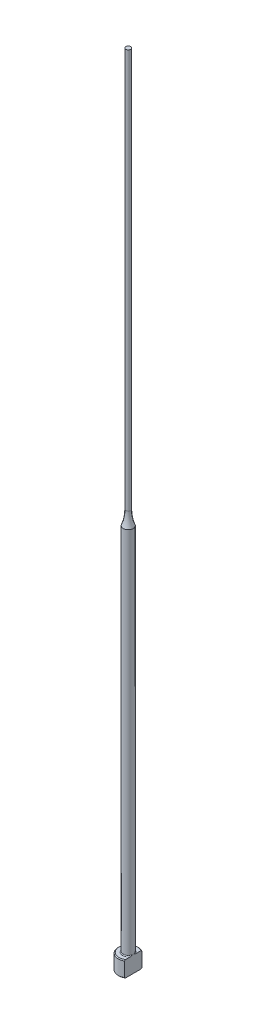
ISO-10303-21;
HEADER;
FILE_DESCRIPTION(('STEP AP214'),'2;1');
FILE_NAME('part.step','',(''),(''),'','','');
FILE_SCHEMA(('AUTOMOTIVE_DESIGN { 1 0 10303 214 1 1 1 1 }'));
ENDSEC;
DATA;
#1=APPLICATION_CONTEXT('core data for automotive mechanical design processes');
#2=APPLICATION_PROTOCOL_DEFINITION('international standard','automotive_design',2000,#1);
#3=PRODUCT_CONTEXT('',#1,'mechanical');
#4=PRODUCT('Part','Part','',(#3));
#5=PRODUCT_RELATED_PRODUCT_CATEGORY('part','',(#4));
#6=PRODUCT_DEFINITION_FORMATION('','',#4);
#7=PRODUCT_DEFINITION_CONTEXT('part definition',#1,'design');
#8=PRODUCT_DEFINITION('design','',#6,#7);
#9=PRODUCT_DEFINITION_SHAPE('','',#8);
#10=(LENGTH_UNIT() NAMED_UNIT(*) SI_UNIT(.MILLI.,.METRE.));
#11=(NAMED_UNIT(*) PLANE_ANGLE_UNIT() SI_UNIT($,.RADIAN.));
#12=(NAMED_UNIT(*) SI_UNIT($,.STERADIAN.) SOLID_ANGLE_UNIT());
#13=UNCERTAINTY_MEASURE_WITH_UNIT(LENGTH_MEASURE(1.E-05),#10,'distance_accuracy_value','');
#14=(GEOMETRIC_REPRESENTATION_CONTEXT(3) GLOBAL_UNCERTAINTY_ASSIGNED_CONTEXT((#13)) GLOBAL_UNIT_ASSIGNED_CONTEXT((#10,
#11,#12)) REPRESENTATION_CONTEXT('',''));
#15=CARTESIAN_POINT('',(0.,0.,0.));
#16=DIRECTION('',(0.,0.,1.));
#17=DIRECTION('',(1.,0.,0.));
#18=AXIS2_PLACEMENT_3D('',#15,#16,#17);
#19=CARTESIAN_POINT('',(-2.49999999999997,4.,0.));
#20=DIRECTION('',(0.,1.,0.));
#21=DIRECTION('',(0.,0.,1.));
#22=AXIS2_PLACEMENT_3D('',#19,#20,#21);
#23=PLANE('',#22);
#24=CARTESIAN_POINT('',(0.,4.,0.));
#25=DIRECTION('',(0.,1.,0.));
#26=DIRECTION('',(0.,0.,1.));
#27=AXIS2_PLACEMENT_3D('',#24,#25,#26);
#28=CIRCLE('',#27,2.3);
#29=CARTESIAN_POINT('',(1.24999999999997,4.,-1.9306734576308));
#30=VERTEX_POINT('',#29);
#31=CARTESIAN_POINT('',(1.24999999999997,4.,1.9306734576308));
#32=VERTEX_POINT('',#31);
#33=EDGE_CURVE('E187',#30,#32,#28,.T.);
#34=ORIENTED_EDGE('',*,*,#33,.T.);
#35=DIRECTION('',(0.,0.,-1.));
#36=VECTOR('',#35,1.);
#37=CARTESIAN_POINT('',(1.24999999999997,4.,0.));
#38=LINE('',#37,#36);
#39=CARTESIAN_POINT('',(1.24999999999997,3.99999999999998,0.734846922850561));
#40=VERTEX_POINT('',#39);
#41=EDGE_CURVE('E57',#32,#40,#38,.T.);
#42=ORIENTED_EDGE('',*,*,#41,.T.);
#43=CARTESIAN_POINT('',(0.,4.,0.));
#44=DIRECTION('',(0.,1.,0.));
#45=DIRECTION('',(0.,0.,1.));
#46=AXIS2_PLACEMENT_3D('',#43,#44,#45);
#47=CIRCLE('',#46,1.44999999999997);
#48=CARTESIAN_POINT('',(1.24999999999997,3.99999999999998,-0.734846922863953));
#49=VERTEX_POINT('',#48);
#50=EDGE_CURVE('E108',#40,#49,#47,.F.);
#51=ORIENTED_EDGE('',*,*,#50,.T.);
#52=EDGE_CURVE('E137',#49,#30,#38,.T.);
#53=ORIENTED_EDGE('',*,*,#52,.T.);
#54=EDGE_LOOP('',(#34,#42,#51,#53));
#55=FACE_BOUND('',#54,.T.);
#56=ADVANCED_FACE('F32',(#55),#23,.T.);
#57=CARTESIAN_POINT('',(0.,259.958771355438,0.));
#58=DIRECTION('',(0.,1.,0.));
#59=DIRECTION('',(0.,0.,1.));
#60=AXIS2_PLACEMENT_3D('',#57,#58,#59);
#61=CYLINDRICAL_SURFACE('',#60,2.49999999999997);
#62=CARTESIAN_POINT('',(0.,3.80000000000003,0.));
#63=DIRECTION('',(0.,1.,0.));
#64=DIRECTION('',(0.,0.,1.));
#65=AXIS2_PLACEMENT_3D('',#62,#63,#64);
#66=CIRCLE('',#65,2.49999999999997);
#67=CARTESIAN_POINT('',(1.24999999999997,3.80000000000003,2.16506350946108));
#68=VERTEX_POINT('',#67);
#69=CARTESIAN_POINT('',(1.24999999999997,3.80000000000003,-2.16506350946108));
#70=VERTEX_POINT('',#69);
#71=EDGE_CURVE('E105',#68,#70,#66,.F.);
#72=ORIENTED_EDGE('',*,*,#71,.T.);
#73=DIRECTION('',(0.,-1.,0.));
#74=VECTOR('',#73,1.);
#75=CARTESIAN_POINT('',(1.24999999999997,200.,-2.16506350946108));
#76=LINE('',#75,#74);
#77=CARTESIAN_POINT('',(1.24999999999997,0.199999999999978,-2.16506350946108));
#78=VERTEX_POINT('',#77);
#79=EDGE_CURVE('E193',#70,#78,#76,.T.);
#80=ORIENTED_EDGE('',*,*,#79,.T.);
#81=CARTESIAN_POINT('',(0.,0.199999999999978,0.));
#82=DIRECTION('',(0.,-1.,0.));
#83=DIRECTION('',(0.,0.,-1.));
#84=AXIS2_PLACEMENT_3D('',#81,#82,#83);
#85=CIRCLE('',#84,2.49999999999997);
#86=CARTESIAN_POINT('',(1.24999999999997,0.199999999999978,2.16506350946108));
#87=VERTEX_POINT('',#86);
#88=EDGE_CURVE('E100',#78,#87,#85,.F.);
#89=ORIENTED_EDGE('',*,*,#88,.T.);
#90=DIRECTION('',(0.,-1.,0.));
#91=VECTOR('',#90,1.);
#92=CARTESIAN_POINT('',(1.24999999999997,200.,2.16506350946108));
#93=LINE('',#92,#91);
#94=EDGE_CURVE('E93',#68,#87,#93,.T.);
#95=ORIENTED_EDGE('',*,*,#94,.F.);
#96=EDGE_LOOP('',(#72,#80,#89,#95));
#97=FACE_BOUND('',#96,.T.);
#98=ADVANCED_FACE('F158',(#97),#61,.T.);
#99=CARTESIAN_POINT('',(0.,0.,0.));
#100=DIRECTION('',(0.,-1.,0.));
#101=DIRECTION('',(0.,0.,-1.));
#102=AXIS2_PLACEMENT_3D('',#99,#100,#101);
#103=PLANE('',#102);
#104=CARTESIAN_POINT('',(0.,0.,0.));
#105=DIRECTION('',(0.,-1.,0.));
#106=DIRECTION('',(0.,0.,-1.));
#107=AXIS2_PLACEMENT_3D('',#104,#105,#106);
#108=CIRCLE('',#107,2.29999999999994);
#109=CARTESIAN_POINT('',(1.24999999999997,0.,1.93067345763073));
#110=VERTEX_POINT('',#109);
#111=CARTESIAN_POINT('',(1.24999999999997,0.,-1.93067345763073));
#112=VERTEX_POINT('',#111);
#113=EDGE_CURVE('E98',#110,#112,#108,.T.);
#114=ORIENTED_EDGE('',*,*,#113,.T.);
#115=DIRECTION('',(0.,0.,1.));
#116=VECTOR('',#115,1.);
#117=CARTESIAN_POINT('',(1.24999999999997,0.,2.16506350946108));
#118=LINE('',#117,#116);
#119=EDGE_CURVE('E83',#112,#110,#118,.T.);
#120=ORIENTED_EDGE('',*,*,#119,.T.);
#121=EDGE_LOOP('',(#114,#120));
#122=FACE_BOUND('',#121,.T.);
#123=ADVANCED_FACE('F103',(#122),#103,.T.);
#124=CARTESIAN_POINT('',(0.,4.,0.));
#125=DIRECTION('',(0.,-1.,0.));
#126=DIRECTION('',(0.,0.,-1.));
#127=AXIS2_PLACEMENT_3D('',#124,#125,#126);
#128=CONICAL_SURFACE('',#127,2.3,0.785398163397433);
#129=ORIENTED_EDGE('',*,*,#71,.F.);
#130=CARTESIAN_POINT('',(1.24999999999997,1.37269850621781,4.76610952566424));
#131=CARTESIAN_POINT('',(1.24999999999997,1.47721375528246,4.6580533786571));
#132=CARTESIAN_POINT('',(1.24999999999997,1.58161686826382,4.54988840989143));
#133=CARTESIAN_POINT('',(1.24999999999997,1.79013244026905,4.33327605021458));
#134=CARTESIAN_POINT('',(1.24999999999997,1.89424489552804,4.22482865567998));
#135=CARTESIAN_POINT('',(1.24999999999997,2.10216338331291,4.00753373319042));
#136=CARTESIAN_POINT('',(1.24999999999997,2.20596923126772,3.89868602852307));
#137=CARTESIAN_POINT('',(1.24999999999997,2.41312192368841,3.68055575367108));
#138=CARTESIAN_POINT('',(1.24999999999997,2.51646877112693,3.57127318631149));
#139=CARTESIAN_POINT('',(1.24999999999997,2.72052253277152,3.35432408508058));
#140=CARTESIAN_POINT('',(1.24999999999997,2.82124112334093,3.24666854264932));
#141=CARTESIAN_POINT('',(1.24999999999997,3.02192410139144,3.03065701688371));
#142=CARTESIAN_POINT('',(1.24999999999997,3.12188849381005,2.92230103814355));
#143=CARTESIAN_POINT('',(1.24999999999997,3.32077037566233,2.70467415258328));
#144=CARTESIAN_POINT('',(1.24999999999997,3.41968808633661,2.59540344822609));
#145=CARTESIAN_POINT('',(1.24999999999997,3.61608273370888,2.37557697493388));
#146=CARTESIAN_POINT('',(1.24999999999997,3.71355972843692,2.26502125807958));
#147=CARTESIAN_POINT('',(1.24999999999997,3.86911393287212,2.08515617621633));
#148=CARTESIAN_POINT('',(1.24999999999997,3.92785594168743,2.01642247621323));
#149=CARTESIAN_POINT('',(1.24999999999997,4.0442937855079,1.87806056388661));
#150=CARTESIAN_POINT('',(1.24999999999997,4.10198951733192,1.80843226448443));
#151=CARTESIAN_POINT('',(1.24999999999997,4.21658041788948,1.66728976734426));
#152=CARTESIAN_POINT('',(1.24999999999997,4.27346067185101,1.59576341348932));
#153=CARTESIAN_POINT('',(1.24999999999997,4.38522965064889,1.45118948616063));
#154=CARTESIAN_POINT('',(1.24999999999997,4.44011885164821,1.37814228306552));
#155=CARTESIAN_POINT('',(1.24999999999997,4.54788773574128,1.22886697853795));
#156=CARTESIAN_POINT('',(1.24999999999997,4.60072420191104,1.15260740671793));
#157=CARTESIAN_POINT('',(1.24999999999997,4.70212030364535,0.997098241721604));
#158=CARTESIAN_POINT('',(1.24999999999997,4.75067405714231,0.917844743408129));
#159=CARTESIAN_POINT('',(1.24999999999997,4.84043729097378,0.756494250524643));
#160=CARTESIAN_POINT('',(1.24999999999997,4.88173033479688,0.674444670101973));
#161=CARTESIAN_POINT('',(1.24999999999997,4.95366083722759,0.505835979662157));
#162=CARTESIAN_POINT('',(1.24999999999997,4.98433405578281,0.419293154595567));
#163=CARTESIAN_POINT('',(1.24999999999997,5.01753107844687,0.289507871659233));
#164=CARTESIAN_POINT('',(1.24999999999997,5.02633539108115,0.247870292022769));
#165=CARTESIAN_POINT('',(1.24999999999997,5.03997448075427,0.163937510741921));
#166=CARTESIAN_POINT('',(1.24999999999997,5.0448096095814,0.12164236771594));
#167=CARTESIAN_POINT('',(1.24999999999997,5.0501678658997,0.0369068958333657));
#168=CARTESIAN_POINT('',(1.24999999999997,5.05070431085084,-0.00553257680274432));
#169=CARTESIAN_POINT('',(1.24999999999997,5.04746162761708,-0.0902467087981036));
#170=CARTESIAN_POINT('',(1.24999999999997,5.04368214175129,-0.132521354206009));
#171=CARTESIAN_POINT('',(1.24999999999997,5.0321226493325,-0.21613542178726));
#172=CARTESIAN_POINT('',(1.24999999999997,5.02437758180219,-0.2574797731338));
#173=CARTESIAN_POINT('',(1.24999999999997,5.00536735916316,-0.339354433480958));
#174=CARTESIAN_POINT('',(1.24999999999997,4.99410082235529,-0.379884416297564));
#175=CARTESIAN_POINT('',(1.24999999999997,4.96852211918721,-0.460209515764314));
#176=CARTESIAN_POINT('',(1.24999999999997,4.954193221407,-0.499999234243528));
#177=CARTESIAN_POINT('',(1.24999999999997,4.92306392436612,-0.578577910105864));
#178=CARTESIAN_POINT('',(1.24999999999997,4.90626403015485,-0.617367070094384));
#179=CARTESIAN_POINT('',(1.24999999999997,4.85269034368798,-0.732719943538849));
#180=CARTESIAN_POINT('',(1.24999999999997,4.81287978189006,-0.807869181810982));
#181=CARTESIAN_POINT('',(1.24999999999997,4.72799210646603,-0.955157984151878));
#182=CARTESIAN_POINT('',(1.24999999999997,4.68290855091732,-1.02729371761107));
#183=CARTESIAN_POINT('',(1.24999999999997,4.58903993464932,-1.16950551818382));
#184=CARTESIAN_POINT('',(1.24999999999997,4.5402409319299,-1.23957230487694));
#185=CARTESIAN_POINT('',(1.24999999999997,4.44021824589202,-1.37788366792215));
#186=CARTESIAN_POINT('',(1.24999999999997,4.38899576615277,-1.44612912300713));
#187=CARTESIAN_POINT('',(1.24999999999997,4.28411092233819,-1.58215279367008));
#188=CARTESIAN_POINT('',(1.24999999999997,4.23042529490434,-1.64991298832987));
#189=CARTESIAN_POINT('',(1.24999999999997,4.12172412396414,-1.7843605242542));
#190=CARTESIAN_POINT('',(1.24999999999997,4.06670849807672,-1.85104779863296));
#191=CARTESIAN_POINT('',(1.24999999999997,3.90044437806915,-2.04954410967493));
#192=CARTESIAN_POINT('',(1.24999999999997,3.78772044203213,-2.1801152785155));
#193=CARTESIAN_POINT('',(1.24999999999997,3.57927088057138,-2.41711311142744));
#194=CARTESIAN_POINT('',(1.24999999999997,3.48391557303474,-2.52386864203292));
#195=CARTESIAN_POINT('',(1.24999999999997,3.29202937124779,-2.73632311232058));
#196=CARTESIAN_POINT('',(1.24999999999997,3.19549844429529,-2.84202202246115));
#197=CARTESIAN_POINT('',(1.24999999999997,2.90446939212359,-3.15815976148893));
#198=CARTESIAN_POINT('',(1.24999999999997,2.70871394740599,-3.36743889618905));
#199=CARTESIAN_POINT('',(1.24999999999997,2.32338273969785,-3.77561196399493));
#200=CARTESIAN_POINT('',(1.24999999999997,2.13388401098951,-3.97457897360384));
#201=CARTESIAN_POINT('',(1.24999999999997,1.84887947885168,-4.27209258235));
#202=CARTESIAN_POINT('',(1.24999999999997,1.75380504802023,-4.37105278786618));
#203=CARTESIAN_POINT('',(1.24999999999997,1.56341833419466,-4.56874260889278));
#204=CARTESIAN_POINT('',(1.24999999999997,1.46810605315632,-4.66747222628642));
#205=CARTESIAN_POINT('',(1.24999999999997,1.37269850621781,-4.76610952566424));
#206=B_SPLINE_CURVE_WITH_KNOTS('',3,(#130,#131,#132,#133,#134,#135,#136,#137,#138,#139,#140,
#141,#142,#143,#144,#145,#146,#147,#148,#149,#150,#151,#152,#153,#154,#155,#156,#157,#158,#159,
#160,#161,#162,#163,#164,#165,#166,#167,#168,#169,#170,#171,#172,#173,#174,#175,#176,#177,#178,
#179,#180,#181,#182,#183,#184,#185,#186,#187,#188,#189,#190,#191,#192,#193,#194,#195,#196,#197,
#198,#199,#200,#201,#202,#203,#204,#205),.UNSPECIFIED.,.F.,.F.,(4,2,2,2,2,2,2,2,2,2,2,2,2,2,2,2,
2,2,2,2,2,2,2,2,2,2,2,2,2,2,2,2,2,2,2,2,2,4),(0.,0.450994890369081,0.901995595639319,
1.35322763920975,1.80445675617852,2.24672733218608,2.6889950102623,3.13116725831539,
3.57332164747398,3.84456018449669,4.11582532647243,4.38995864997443,4.66402597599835,
4.94225842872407,5.22086725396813,5.49602313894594,5.77024327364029,5.89775644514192,
6.02525831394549,6.15236502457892,6.27948226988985,6.4054983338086,6.531563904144,
6.65833670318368,6.78508362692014,7.03983854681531,7.2949080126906,7.55098686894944,
7.80693985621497,8.06626716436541,8.32561057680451,8.84304654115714,9.27246240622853,
9.70189024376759,10.5615524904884,11.385852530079,11.7975442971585,12.2092326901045),.UNSPECIFIED.);
#207=EDGE_CURVE('E136',#68,#32,#206,.T.);
#208=ORIENTED_EDGE('',*,*,#207,.T.);
#209=ORIENTED_EDGE('',*,*,#33,.F.);
#210=EDGE_CURVE('E128',#30,#70,#206,.T.);
#211=ORIENTED_EDGE('',*,*,#210,.T.);
#212=EDGE_LOOP('',(#129,#208,#209,#211));
#213=FACE_BOUND('',#212,.T.);
#214=ADVANCED_FACE('F144',(#213),#128,.T.);
#215=CARTESIAN_POINT('',(0.,0.199999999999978,0.));
#216=DIRECTION('',(0.,1.,0.));
#217=DIRECTION('',(0.,0.,1.));
#218=AXIS2_PLACEMENT_3D('',#215,#216,#217);
#219=CONICAL_SURFACE('',#218,2.49999999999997,0.785398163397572);
#220=ORIENTED_EDGE('',*,*,#88,.F.);
#221=CARTESIAN_POINT('',(1.24999999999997,2.62730149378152,-4.76610952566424));
#222=CARTESIAN_POINT('',(1.24999999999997,2.52278624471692,-4.65805337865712));
#223=CARTESIAN_POINT('',(1.24999999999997,2.41838313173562,-4.54988840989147));
#224=CARTESIAN_POINT('',(1.24999999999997,2.20986755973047,-4.33327605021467));
#225=CARTESIAN_POINT('',(1.24999999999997,2.10575510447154,-4.22482865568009));
#226=CARTESIAN_POINT('',(1.24999999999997,1.89783661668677,-4.00753373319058));
#227=CARTESIAN_POINT('',(1.24999999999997,1.794030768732,-3.89868602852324));
#228=CARTESIAN_POINT('',(1.24999999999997,1.58687807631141,-3.6805557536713));
#229=CARTESIAN_POINT('',(1.24999999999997,1.48353122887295,-3.57127318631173));
#230=CARTESIAN_POINT('',(1.24999999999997,1.27947746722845,-3.35432408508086));
#231=CARTESIAN_POINT('',(1.24999999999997,1.17875887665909,-3.24666854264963));
#232=CARTESIAN_POINT('',(1.24999999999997,0.978075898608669,-3.03065701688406));
#233=CARTESIAN_POINT('',(1.24999999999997,0.878111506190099,-2.92230103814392));
#234=CARTESIAN_POINT('',(1.24999999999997,0.67922962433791,-2.70467415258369));
#235=CARTESIAN_POINT('',(1.24999999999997,0.580311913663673,-2.59540344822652));
#236=CARTESIAN_POINT('',(1.24999999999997,0.383917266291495,-2.37557697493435));
#237=CARTESIAN_POINT('',(1.24999999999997,0.286440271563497,-2.26502125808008));
#238=CARTESIAN_POINT('',(1.24999999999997,0.130886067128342,-2.08515617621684));
#239=CARTESIAN_POINT('',(1.24999999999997,0.0721440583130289,-2.01642247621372));
#240=CARTESIAN_POINT('',(1.24999999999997,-0.0442937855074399,-1.87806056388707));
#241=CARTESIAN_POINT('',(1.24999999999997,-0.101989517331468,-1.80843226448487));
#242=CARTESIAN_POINT('',(1.24999999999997,-0.216580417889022,-1.66728976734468));
#243=CARTESIAN_POINT('',(1.24999999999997,-0.273460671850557,-1.59576341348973));
#244=CARTESIAN_POINT('',(1.24999999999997,-0.385229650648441,-1.45118948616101));
#245=CARTESIAN_POINT('',(1.24999999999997,-0.440118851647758,-1.37814228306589));
#246=CARTESIAN_POINT('',(1.24999999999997,-0.547887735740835,-1.22886697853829));
#247=CARTESIAN_POINT('',(1.24999999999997,-0.600724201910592,-1.15260740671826));
#248=CARTESIAN_POINT('',(1.24999999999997,-0.702120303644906,-0.99709824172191));
#249=CARTESIAN_POINT('',(1.24999999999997,-0.750674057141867,-0.917844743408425));
#250=CARTESIAN_POINT('',(1.24999999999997,-0.840437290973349,-0.756494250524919));
#251=CARTESIAN_POINT('',(1.24999999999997,-0.881730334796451,-0.67444467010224));
#252=CARTESIAN_POINT('',(1.24999999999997,-0.953660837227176,-0.505835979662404));
#253=CARTESIAN_POINT('',(1.24999999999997,-0.984334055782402,-0.419293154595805));
#254=CARTESIAN_POINT('',(1.24999999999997,-1.01753107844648,-0.289507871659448));
#255=CARTESIAN_POINT('',(1.24999999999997,-1.02633539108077,-0.247870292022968));
#256=CARTESIAN_POINT('',(1.24999999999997,-1.0399744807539,-0.163937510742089));
#257=CARTESIAN_POINT('',(1.24999999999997,-1.04480960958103,-0.121642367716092));
#258=CARTESIAN_POINT('',(1.24999999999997,-1.05016786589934,-0.036906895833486));
#259=CARTESIAN_POINT('',(1.24999999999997,-1.05070431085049,0.00553257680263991));
#260=CARTESIAN_POINT('',(1.24999999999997,-1.04746162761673,0.0902467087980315));
#261=CARTESIAN_POINT('',(1.24999999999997,-1.04368214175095,0.132521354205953));
#262=CARTESIAN_POINT('',(1.24999999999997,-1.03212264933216,0.216135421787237));
#263=CARTESIAN_POINT('',(1.24999999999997,-1.02437758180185,0.257479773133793));
#264=CARTESIAN_POINT('',(1.24999999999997,-1.00536735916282,0.339354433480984));
#265=CARTESIAN_POINT('',(1.24999999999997,-0.99410082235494,0.379884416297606));
#266=CARTESIAN_POINT('',(1.24999999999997,-0.968522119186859,0.460209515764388));
#267=CARTESIAN_POINT('',(1.24999999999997,-0.954193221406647,0.499999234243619));
#268=CARTESIAN_POINT('',(1.24999999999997,-0.923063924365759,0.578577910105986));
#269=CARTESIAN_POINT('',(1.24999999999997,-0.906264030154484,0.617367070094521));
#270=CARTESIAN_POINT('',(1.24999999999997,-0.852690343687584,0.732719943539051));
#271=CARTESIAN_POINT('',(1.24999999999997,-0.812879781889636,0.807869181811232));
#272=CARTESIAN_POINT('',(1.24999999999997,-0.72799210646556,0.955157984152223));
#273=CARTESIAN_POINT('',(1.24999999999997,-0.682908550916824,1.02729371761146));
#274=CARTESIAN_POINT('',(1.24999999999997,-0.58903993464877,1.1695055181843));
#275=CARTESIAN_POINT('',(1.24999999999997,-0.540240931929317,1.23957230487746));
#276=CARTESIAN_POINT('',(1.24999999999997,-0.440218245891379,1.37788366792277));
#277=CARTESIAN_POINT('',(1.24999999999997,-0.388995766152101,1.44612912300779));
#278=CARTESIAN_POINT('',(1.24999999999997,-0.284110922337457,1.58215279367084));
#279=CARTESIAN_POINT('',(1.24999999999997,-0.230425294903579,1.64991298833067));
#280=CARTESIAN_POINT('',(1.24999999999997,-0.121724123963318,1.78436052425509));
#281=CARTESIAN_POINT('',(1.24999999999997,-0.066708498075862,1.8510477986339));
#282=CARTESIAN_POINT('',(1.24999999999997,0.0995556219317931,2.049544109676));
#283=CARTESIAN_POINT('',(1.24999999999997,0.212279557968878,2.18011527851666));
#284=CARTESIAN_POINT('',(1.24999999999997,0.420729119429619,2.41711311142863));
#285=CARTESIAN_POINT('',(1.24999999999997,0.516084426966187,2.52386864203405));
#286=CARTESIAN_POINT('',(1.24999999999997,0.707970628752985,2.73632311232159));
#287=CARTESIAN_POINT('',(1.24999999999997,0.804501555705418,2.84202202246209));
#288=CARTESIAN_POINT('',(1.24999999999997,1.09553060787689,3.1581597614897));
#289=CARTESIAN_POINT('',(1.24999999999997,1.29128605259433,3.36743889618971));
#290=CARTESIAN_POINT('',(1.24999999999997,1.67661726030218,3.77561196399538));
#291=CARTESIAN_POINT('',(1.24999999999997,1.86611598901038,3.97457897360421));
#292=CARTESIAN_POINT('',(1.24999999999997,2.151120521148,4.27209258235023));
#293=CARTESIAN_POINT('',(1.24999999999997,2.24619495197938,4.37105278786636));
#294=CARTESIAN_POINT('',(1.24999999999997,2.43658166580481,4.56874260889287));
#295=CARTESIAN_POINT('',(1.24999999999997,2.53189394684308,4.66747222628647));
#296=CARTESIAN_POINT('',(1.24999999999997,2.62730149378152,4.76610952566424));
#297=B_SPLINE_CURVE_WITH_KNOTS('',3,(#221,#222,#223,#224,#225,#226,#227,#228,#229,#230,#231,
#232,#233,#234,#235,#236,#237,#238,#239,#240,#241,#242,#243,#244,#245,#246,#247,#248,#249,#250,
#251,#252,#253,#254,#255,#256,#257,#258,#259,#260,#261,#262,#263,#264,#265,#266,#267,#268,#269,
#270,#271,#272,#273,#274,#275,#276,#277,#278,#279,#280,#281,#282,#283,#284,#285,#286,#287,#288,
#289,#290,#291,#292,#293,#294,#295,#296),.UNSPECIFIED.,.F.,.F.,(4,2,2,2,2,2,2,2,2,2,2,2,2,2,2,2,
2,2,2,2,2,2,2,2,2,2,2,2,2,2,2,2,2,2,2,2,2,4),(0.,0.45099489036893,0.901995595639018,
1.3532276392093,1.80445675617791,2.24672733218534,2.68899501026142,3.13116725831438,
3.57332164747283,3.84456018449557,4.11582532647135,4.38995864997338,4.66402597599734,
4.94225842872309,5.22086725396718,5.49602313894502,5.77024327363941,5.89775644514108,
6.0252583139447,6.15236502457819,6.27948226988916,6.40549833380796,6.5315639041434,
6.65833670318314,6.78508362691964,7.03983854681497,7.29490801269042,7.55098686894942,
7.80693985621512,8.06626716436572,8.32561057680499,8.84304654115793,9.27246240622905,
9.70189024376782,10.5615524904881,11.3858525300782,11.7975442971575,12.2092326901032),.UNSPECIFIED.);
#298=EDGE_CURVE('E86',#78,#112,#297,.T.);
#299=ORIENTED_EDGE('',*,*,#298,.T.);
#300=ORIENTED_EDGE('',*,*,#113,.F.);
#301=EDGE_CURVE('E89',#110,#87,#297,.T.);
#302=ORIENTED_EDGE('',*,*,#301,.T.);
#303=EDGE_LOOP('',(#220,#299,#300,#302));
#304=FACE_BOUND('',#303,.T.);
#305=ADVANCED_FACE('F97',(#304),#219,.T.);
#306=CARTESIAN_POINT('',(0.,4.19999999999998,0.));
#307=DIRECTION('',(0.,1.,0.));
#308=DIRECTION('',(0.,0.,1.));
#309=AXIS2_PLACEMENT_3D('',#306,#307,#308);
#310=TOROIDAL_SURFACE('',#309,1.44999999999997,0.2);
#311=CARTESIAN_POINT('',(1.24999999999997,4.19999999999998,0.));
#312=CARTESIAN_POINT('',(1.24999999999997,4.20000051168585,-1.97682160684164E-10));
#313=CARTESIAN_POINT('',(1.24999999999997,4.20000102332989,-1.08908071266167E-07));
#314=CARTESIAN_POINT('',(1.24999999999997,4.20000200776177,-4.52594777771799E-07));
#315=CARTESIAN_POINT('',(1.24999999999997,4.20000247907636,-6.9099305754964E-07));
#316=CARTESIAN_POINT('',(1.24999999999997,4.20000341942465,-1.26357946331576E-06));
#317=CARTESIAN_POINT('',(1.24999999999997,4.20000388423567,-1.60457621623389E-06));
#318=CARTESIAN_POINT('',(1.24999999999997,4.20000476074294,-2.33954904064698E-06));
#319=CARTESIAN_POINT('',(1.24999999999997,4.2000051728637,-2.73304152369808E-06));
#320=CARTESIAN_POINT('',(1.24999999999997,4.20000655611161,-4.14544018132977E-06));
#321=CARTESIAN_POINT('',(1.24999999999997,4.20000745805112,-5.23310098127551E-06));
#322=CARTESIAN_POINT('',(1.24999999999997,4.20000906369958,-7.47950368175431E-06));
#323=CARTESIAN_POINT('',(1.24999999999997,4.20000977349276,-8.63414445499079E-06));
#324=CARTESIAN_POINT('',(1.24999999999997,4.20001244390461,-1.31453477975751E-05));
#325=CARTESIAN_POINT('',(1.24999999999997,4.20001426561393,-1.65880556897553E-05));
#326=CARTESIAN_POINT('',(1.24999999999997,4.20001724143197,-2.33729030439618E-05));
#327=CARTESIAN_POINT('',(1.24999999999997,4.20001844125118,-2.66956155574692E-05));
#328=CARTESIAN_POINT('',(1.24999999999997,4.20002354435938,-4.08635087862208E-05));
#329=CARTESIAN_POINT('',(1.24999999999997,4.20002741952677,-5.17114616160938E-05));
#330=CARTESIAN_POINT('',(1.24999999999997,4.20003363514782,-7.2005767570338E-05));
#331=CARTESIAN_POINT('',(1.24999999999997,4.20003612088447,-8.14057067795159E-05));
#332=CARTESIAN_POINT('',(1.24999999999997,4.20005581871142,-0.000149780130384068));
#333=CARTESIAN_POINT('',(1.24999999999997,4.20008094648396,-0.00020612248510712));
#334=CARTESIAN_POINT('',(1.24999999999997,4.20017507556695,-0.000425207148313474));
#335=CARTESIAN_POINT('',(1.24999999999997,4.20023819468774,-0.000589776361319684));
#336=CARTESIAN_POINT('',(1.24999999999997,4.20048692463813,-0.00122878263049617));
#337=CARTESIAN_POINT('',(1.24999999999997,4.20067870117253,-0.00170134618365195));
#338=CARTESIAN_POINT('',(1.24999999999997,4.2014602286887,-0.00363636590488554));
#339=CARTESIAN_POINT('',(1.24999999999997,4.20204298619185,-0.00510090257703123));
#340=CARTESIAN_POINT('',(1.24999999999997,4.20939719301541,-0.0235712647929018));
#341=CARTESIAN_POINT('',(1.24999999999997,4.21621259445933,-0.0405643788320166));
#342=CARTESIAN_POINT('',(1.24999999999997,4.22951000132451,-0.0739606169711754));
#343=CARTESIAN_POINT('',(1.24999999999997,4.23599508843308,-0.0903626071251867));
#344=CARTESIAN_POINT('',(1.24999999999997,4.24961430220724,-0.125111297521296));
#345=CARTESIAN_POINT('',(1.24999999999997,4.2567364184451,-0.1434628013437));
#346=CARTESIAN_POINT('',(1.24999999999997,4.27085039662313,-0.180427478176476));
#347=CARTESIAN_POINT('',(1.24999999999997,4.27784022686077,-0.199041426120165));
#348=CARTESIAN_POINT('',(1.24999999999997,4.29479134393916,-0.245221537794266));
#349=CARTESIAN_POINT('',(1.24999999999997,4.30459026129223,-0.272848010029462));
#350=CARTESIAN_POINT('',(1.24999999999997,4.32310234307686,-0.327738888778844));
#351=CARTESIAN_POINT('',(1.24999999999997,4.3318356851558,-0.354996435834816));
#352=CARTESIAN_POINT('',(1.24999999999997,4.3493656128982,-0.413744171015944));
#353=CARTESIAN_POINT('',(1.24999999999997,4.35799470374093,-0.44528522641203));
#354=CARTESIAN_POINT('',(1.24999999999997,4.37338463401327,-0.50909191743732));
#355=CARTESIAN_POINT('',(1.24999999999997,4.38013036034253,-0.541361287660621));
#356=CARTESIAN_POINT('',(1.24999999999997,4.39136059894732,-0.608339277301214));
#357=CARTESIAN_POINT('',(1.24999999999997,4.39568167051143,-0.643076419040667));
#358=CARTESIAN_POINT('',(1.24999999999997,4.40037605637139,-0.712733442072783));
#359=CARTESIAN_POINT('',(1.24999999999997,4.40076553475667,-0.747651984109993));
#360=CARTESIAN_POINT('',(1.24999999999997,4.39677668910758,-0.808103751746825));
#361=CARTESIAN_POINT('',(1.24999999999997,4.39361441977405,-0.833711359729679));
#362=CARTESIAN_POINT('',(1.24999999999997,4.38355990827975,-0.883915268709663));
#363=CARTESIAN_POINT('',(1.24999999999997,4.37671813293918,-0.908520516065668));
#364=CARTESIAN_POINT('',(1.24999999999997,4.36252570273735,-0.944879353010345));
#365=CARTESIAN_POINT('',(1.24999999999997,4.35688428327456,-0.957298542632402));
#366=CARTESIAN_POINT('',(1.24999999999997,4.34399066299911,-0.981318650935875));
#367=CARTESIAN_POINT('',(1.24999999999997,4.33673636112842,-0.992918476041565));
#368=CARTESIAN_POINT('',(1.24999999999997,4.32199744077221,-1.01267533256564));
#369=CARTESIAN_POINT('',(1.24999999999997,4.31482723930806,-1.02106482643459));
#370=CARTESIAN_POINT('',(1.24999999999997,4.29924321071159,-1.03659690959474));
#371=CARTESIAN_POINT('',(1.24999999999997,4.29083198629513,-1.04374204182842));
#372=CARTESIAN_POINT('',(1.24999999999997,4.27498600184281,-1.05478694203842));
#373=CARTESIAN_POINT('',(1.24999999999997,4.26780814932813,-1.059053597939));
#374=CARTESIAN_POINT('',(1.24999999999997,4.25284782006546,-1.06635953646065));
#375=CARTESIAN_POINT('',(1.24999999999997,4.24506572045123,-1.06939957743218));
#376=CARTESIAN_POINT('',(1.24999999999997,4.22901828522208,-1.07404931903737));
#377=CARTESIAN_POINT('',(1.24999999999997,4.22074990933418,-1.07564870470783));
#378=CARTESIAN_POINT('',(1.24999999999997,4.20405985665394,-1.07723717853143));
#379=CARTESIAN_POINT('',(1.24999999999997,4.19563825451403,-1.07722703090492));
#380=CARTESIAN_POINT('',(1.24999999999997,4.17988128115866,-1.07569157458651));
#381=CARTESIAN_POINT('',(1.24999999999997,4.17252879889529,-1.0743339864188));
#382=CARTESIAN_POINT('',(1.24999999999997,4.15814333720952,-1.07044616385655));
#383=CARTESIAN_POINT('',(1.24999999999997,4.15111040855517,-1.06791574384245));
#384=CARTESIAN_POINT('',(1.24999999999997,4.13724955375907,-1.06171920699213));
#385=CARTESIAN_POINT('',(1.24999999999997,4.13043935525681,-1.05801386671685));
#386=CARTESIAN_POINT('',(1.24999999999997,4.11740316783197,-1.04969609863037));
#387=CARTESIAN_POINT('',(1.24999999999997,4.11117742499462,-1.04508329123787));
#388=CARTESIAN_POINT('',(1.24999999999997,4.0958619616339,-1.03220341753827));
#389=CARTESIAN_POINT('',(1.24999999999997,4.08723799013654,-1.02338140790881));
#390=CARTESIAN_POINT('',(1.24999999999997,4.07148817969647,-1.00448021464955));
#391=CARTESIAN_POINT('',(1.24999999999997,4.06436716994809,-0.994397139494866));
#392=CARTESIAN_POINT('',(1.24999999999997,4.04800089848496,-0.96769446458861));
#393=CARTESIAN_POINT('',(1.24999999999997,4.0397014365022,-0.950498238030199));
#394=CARTESIAN_POINT('',(1.24999999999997,4.02582422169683,-0.915117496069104));
#395=CARTESIAN_POINT('',(1.24999999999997,4.02024415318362,-0.89693383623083));
#396=CARTESIAN_POINT('',(1.24999999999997,4.00805724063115,-0.846781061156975));
#397=CARTESIAN_POINT('',(1.24999999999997,4.00359525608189,-0.814297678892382));
#398=CARTESIAN_POINT('',(1.24999999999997,3.99933348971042,-0.748574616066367));
#399=CARTESIAN_POINT('',(1.24999999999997,3.99961552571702,-0.71533156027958));
#400=CARTESIAN_POINT('',(1.24999999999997,4.00446632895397,-0.637920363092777));
#401=CARTESIAN_POINT('',(1.24999999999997,4.0104488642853,-0.593849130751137));
#402=CARTESIAN_POINT('',(1.24999999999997,4.02681929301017,-0.50640159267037));
#403=CARTESIAN_POINT('',(1.24999999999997,4.03722697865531,-0.463029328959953));
#404=CARTESIAN_POINT('',(1.24999999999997,4.060071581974,-0.380638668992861));
#405=CARTESIAN_POINT('',(1.24999999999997,4.07227412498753,-0.34155342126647));
#406=CARTESIAN_POINT('',(1.24999999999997,4.09824323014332,-0.264347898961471));
#407=CARTESIAN_POINT('',(1.24999999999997,4.11199311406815,-0.226221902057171));
#408=CARTESIAN_POINT('',(1.24999999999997,4.13108825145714,-0.175350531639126));
#409=CARTESIAN_POINT('',(1.24999999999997,4.13599999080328,-0.162438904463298));
#410=CARTESIAN_POINT('',(1.24999999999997,4.14604281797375,-0.136318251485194));
#411=CARTESIAN_POINT('',(1.24999999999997,4.15117629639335,-0.123110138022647));
#412=CARTESIAN_POINT('',(1.24999999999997,4.16341702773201,-0.0918425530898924));
#413=CARTESIAN_POINT('',(1.24999999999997,4.17055250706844,-0.0737943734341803));
#414=CARTESIAN_POINT('',(1.24999999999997,4.18426943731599,-0.0393586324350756));
#415=CARTESIAN_POINT('',(1.24999999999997,4.19084281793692,-0.0229681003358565));
#416=CARTESIAN_POINT('',(1.24999999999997,4.19795564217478,-0.00510438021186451));
#417=CARTESIAN_POINT('',(1.24999999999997,4.19853702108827,-0.00364331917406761));
#418=CARTESIAN_POINT('',(1.24999999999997,4.19931818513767,-0.00170914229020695));
#419=CARTESIAN_POINT('',(1.24999999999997,4.19951102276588,-0.00123396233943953));
#420=CARTESIAN_POINT('',(1.24999999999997,4.19976104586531,-0.000591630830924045));
#421=CARTESIAN_POINT('',(1.24999999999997,4.19982443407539,-0.000426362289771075));
#422=CARTESIAN_POINT('',(1.24999999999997,4.19991892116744,-0.000206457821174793));
#423=CARTESIAN_POINT('',(1.24999999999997,4.19994410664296,-0.000149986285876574));
#424=CARTESIAN_POINT('',(1.24999999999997,4.19996383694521,-8.14647488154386E-05));
#425=CARTESIAN_POINT('',(1.24999999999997,4.19996632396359,-7.20551568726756E-05));
#426=CARTESIAN_POINT('',(1.24999999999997,4.19997254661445,-5.17396177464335E-05));
#427=CARTESIAN_POINT('',(1.24999999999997,4.19997642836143,-4.08803463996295E-05));
#428=CARTESIAN_POINT('',(1.24999999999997,4.19998153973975,-2.66997573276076E-05));
#429=CARTESIAN_POINT('',(1.24999999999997,4.19998274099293,-2.33755457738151E-05));
#430=CARTESIAN_POINT('',(1.24999999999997,4.1999857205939,-1.65878758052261E-05));
#431=CARTESIAN_POINT('',(1.24999999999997,4.19998754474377,-1.31438994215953E-05));
#432=CARTESIAN_POINT('',(1.24999999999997,4.19999021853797,-8.63150511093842E-06));
#433=CARTESIAN_POINT('',(1.24999999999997,4.19999092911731,-7.47674880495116E-06));
#434=CARTESIAN_POINT('',(1.24999999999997,4.19999253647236,-5.23027080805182E-06));
#435=CARTESIAN_POINT('',(1.24999999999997,4.19999343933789,-4.14265821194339E-06));
#436=CARTESIAN_POINT('',(1.24999999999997,4.19999482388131,-2.73051190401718E-06));
#437=CARTESIAN_POINT('',(1.24999999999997,4.19999523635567,-2.33712918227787E-06));
#438=CARTESIAN_POINT('',(1.24999999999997,4.1999961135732,-1.60243917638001E-06));
#439=CARTESIAN_POINT('',(1.24999999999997,4.19999657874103,-1.26161620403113E-06));
#440=CARTESIAN_POINT('',(1.24999999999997,4.19999751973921,-6.89449589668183E-07));
#441=CARTESIAN_POINT('',(1.24999999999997,4.1999979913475,-4.51288695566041E-07));
#442=CARTESIAN_POINT('',(1.24999999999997,4.19999897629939,-1.08178106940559E-07));
#443=CARTESIAN_POINT('',(1.24999999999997,4.19999948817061,1.97737602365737E-10));
#444=CARTESIAN_POINT('',(1.24999999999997,4.19999999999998,0.));
#445=B_SPLINE_CURVE_WITH_KNOTS('',3,(#311,#312,#313,#314,#315,#316,#317,#318,#319,#320,#321,
#322,#323,#324,#325,#326,#327,#328,#329,#330,#331,#332,#333,#334,#335,#336,#337,#338,#339,#340,
#341,#342,#343,#344,#345,#346,#347,#348,#349,#350,#351,#352,#353,#354,#355,#356,#357,#358,#359,
#360,#361,#362,#363,#364,#365,#366,#367,#368,#369,#370,#371,#372,#373,#374,#375,#376,#377,#378,
#379,#380,#381,#382,#383,#384,#385,#386,#387,#388,#389,#390,#391,#392,#393,#394,#395,#396,#397,
#398,#399,#400,#401,#402,#403,#404,#405,#406,#407,#408,#409,#410,#411,#412,#413,#414,#415,#416,
#417,#418,#419,#420,#421,#422,#423,#424,#425,#426,#427,#428,#429,#430,#431,#432,#433,#434,#435,
#436,#437,#438,#439,#440,#441,#442,#443,#444),.UNSPECIFIED.,.T.,.F.,(4,2,2,2,2,2,2,2,2,2,2,2,2,
2,2,2,2,2,2,2,2,2,2,2,2,2,2,2,2,2,2,2,2,2,2,2,2,2,2,2,2,2,2,2,2,2,2,2,2,2,2,2,2,2,2,2,2,2,2,2,2,
2,2,2,2,2,4),(0.,1.53427571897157E-06,3.11115051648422E-06,4.83351630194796E-06,
6.54098938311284E-06,1.07594292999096E-05,1.48222850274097E-05,2.64707312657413E-05,
3.70576286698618E-05,7.16088725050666E-05,0.000100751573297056,0.000285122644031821,
0.00081447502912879,0.00234373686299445,0.00707317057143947,0.0619940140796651,
0.114907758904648,0.17396170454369,0.233609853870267,0.321537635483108,0.40738870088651,
0.505443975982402,0.604264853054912,0.709126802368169,0.813557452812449,0.890773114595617,
0.966955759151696,1.00778845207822,1.04867465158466,1.08167318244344,1.11460346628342,
1.13955805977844,1.16449720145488,1.1896135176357,1.2147179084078,1.23704542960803,
1.25937648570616,1.28254952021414,1.30573226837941,1.34253218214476,1.37944859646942,
1.43640829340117,1.49331940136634,1.59113685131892,1.69064301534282,1.82371118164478,
1.9573808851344,2.08016146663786,2.20172662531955,2.2431696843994,2.28568093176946,
2.34390494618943,2.39687801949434,2.40159623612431,2.40313396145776,2.40366556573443,
2.40385035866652,2.40387953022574,2.403914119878,2.40392471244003,2.403936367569,
2.4039404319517,2.40394465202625,2.40394636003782,2.403948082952,2.40394966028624,
2.40395119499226),.UNSPECIFIED.);
#446=CARTESIAN_POINT('',(1.24999999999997,4.19999999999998,0.));
#447=VERTEX_POINT('',#446);
#448=EDGE_CURVE('E11',#49,#447,#445,.T.);
#449=ORIENTED_EDGE('',*,*,#448,.F.);
#450=ORIENTED_EDGE('',*,*,#50,.F.);
#451=CARTESIAN_POINT('',(1.24999999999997,4.19999999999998,0.));
#452=CARTESIAN_POINT('',(1.24999999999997,4.19999948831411,1.9768217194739E-10));
#453=CARTESIAN_POINT('',(1.24999999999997,4.19999897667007,1.08908071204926E-07));
#454=CARTESIAN_POINT('',(1.24999999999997,4.19999799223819,4.52594777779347E-07));
#455=CARTESIAN_POINT('',(1.24999999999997,4.19999752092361,6.9099305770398E-07));
#456=CARTESIAN_POINT('',(1.24999999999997,4.19999658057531,1.26357946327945E-06));
#457=CARTESIAN_POINT('',(1.24999999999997,4.19999611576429,1.6045762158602E-06));
#458=CARTESIAN_POINT('',(1.24999999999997,4.19999523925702,2.33954904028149E-06));
#459=CARTESIAN_POINT('',(1.24999999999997,4.19999482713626,2.73304152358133E-06));
#460=CARTESIAN_POINT('',(1.24999999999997,4.19999344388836,4.14544018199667E-06));
#461=CARTESIAN_POINT('',(1.24999999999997,4.19999254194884,5.23310098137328E-06));
#462=CARTESIAN_POINT('',(1.24999999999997,4.19999093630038,7.47950368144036E-06));
#463=CARTESIAN_POINT('',(1.24999999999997,4.19999022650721,8.63414445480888E-06));
#464=CARTESIAN_POINT('',(1.24999999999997,4.19998755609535,1.31453477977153E-05));
#465=CARTESIAN_POINT('',(1.24999999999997,4.19998573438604,1.65880556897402E-05));
#466=CARTESIAN_POINT('',(1.24999999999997,4.19998275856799,2.33729030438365E-05));
#467=CARTESIAN_POINT('',(1.24999999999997,4.19998155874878,2.66956155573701E-05));
#468=CARTESIAN_POINT('',(1.24999999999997,4.19997645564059,4.0863508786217E-05));
#469=CARTESIAN_POINT('',(1.24999999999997,4.1999725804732,5.17114616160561E-05));
#470=CARTESIAN_POINT('',(1.24999999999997,4.19996636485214,7.20057675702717E-05));
#471=CARTESIAN_POINT('',(1.24999999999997,4.19996387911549,8.1405706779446E-05));
#472=CARTESIAN_POINT('',(1.24999999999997,4.19994418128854,0.000149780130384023));
#473=CARTESIAN_POINT('',(1.24999999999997,4.199919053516,0.000206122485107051));
#474=CARTESIAN_POINT('',(1.24999999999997,4.19982492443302,0.000425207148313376));
#475=CARTESIAN_POINT('',(1.24999999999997,4.19976180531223,0.000589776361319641));
#476=CARTESIAN_POINT('',(1.24999999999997,4.19951307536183,0.00122878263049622));
#477=CARTESIAN_POINT('',(1.24999999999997,4.19932129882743,0.00170134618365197));
#478=CARTESIAN_POINT('',(1.24999999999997,4.19853977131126,0.00363636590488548));
#479=CARTESIAN_POINT('',(1.24999999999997,4.19795701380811,0.0051009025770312));
#480=CARTESIAN_POINT('',(1.24999999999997,4.19060280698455,0.0235712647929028));
#481=CARTESIAN_POINT('',(1.24999999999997,4.18378740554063,0.0405643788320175));
#482=CARTESIAN_POINT('',(1.24999999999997,4.17048999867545,0.073960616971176));
#483=CARTESIAN_POINT('',(1.24999999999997,4.16400491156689,0.0903626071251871));
#484=CARTESIAN_POINT('',(1.24999999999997,4.15038569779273,0.125111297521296));
#485=CARTESIAN_POINT('',(1.24999999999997,4.14326358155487,0.1434628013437));
#486=CARTESIAN_POINT('',(1.24999999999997,4.12914960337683,0.180427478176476));
#487=CARTESIAN_POINT('',(1.24999999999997,4.12215977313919,0.199041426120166));
#488=CARTESIAN_POINT('',(1.24999999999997,4.1052086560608,0.245221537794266));
#489=CARTESIAN_POINT('',(1.24999999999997,4.09540973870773,0.272848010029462));
#490=CARTESIAN_POINT('',(1.24999999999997,4.0768976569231,0.327738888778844));
#491=CARTESIAN_POINT('',(1.24999999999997,4.06816431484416,0.354996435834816));
#492=CARTESIAN_POINT('',(1.24999999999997,4.05063438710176,0.413744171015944));
#493=CARTESIAN_POINT('',(1.24999999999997,4.04200529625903,0.44528522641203));
#494=CARTESIAN_POINT('',(1.24999999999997,4.0266153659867,0.50909191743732));
#495=CARTESIAN_POINT('',(1.24999999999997,4.01986963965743,0.541361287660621));
#496=CARTESIAN_POINT('',(1.24999999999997,4.00863940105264,0.608339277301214));
#497=CARTESIAN_POINT('',(1.24999999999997,4.00431832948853,0.643076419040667));
#498=CARTESIAN_POINT('',(1.24999999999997,3.99962394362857,0.712733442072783));
#499=CARTESIAN_POINT('',(1.24999999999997,3.99923446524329,0.747651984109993));
#500=CARTESIAN_POINT('',(1.24999999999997,4.00322331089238,0.808103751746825));
#501=CARTESIAN_POINT('',(1.24999999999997,4.00638558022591,0.833711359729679));
#502=CARTESIAN_POINT('',(1.24999999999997,4.01644009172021,0.883915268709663));
#503=CARTESIAN_POINT('',(1.24999999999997,4.02328186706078,0.908520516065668));
#504=CARTESIAN_POINT('',(1.24999999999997,4.03747429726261,0.944879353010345));
#505=CARTESIAN_POINT('',(1.24999999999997,4.0431157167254,0.957298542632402));
#506=CARTESIAN_POINT('',(1.24999999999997,4.05600933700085,0.981318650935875));
#507=CARTESIAN_POINT('',(1.24999999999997,4.06326363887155,0.992918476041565));
#508=CARTESIAN_POINT('',(1.24999999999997,4.07800255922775,1.01267533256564));
#509=CARTESIAN_POINT('',(1.24999999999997,4.08517276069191,1.02106482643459));
#510=CARTESIAN_POINT('',(1.24999999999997,4.10075678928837,1.03659690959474));
#511=CARTESIAN_POINT('',(1.24999999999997,4.10916801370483,1.04374204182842));
#512=CARTESIAN_POINT('',(1.24999999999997,4.12501399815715,1.05478694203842));
#513=CARTESIAN_POINT('',(1.24999999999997,4.13219185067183,1.059053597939));
#514=CARTESIAN_POINT('',(1.24999999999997,4.1471521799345,1.06635953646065));
#515=CARTESIAN_POINT('',(1.24999999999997,4.15493427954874,1.06939957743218));
#516=CARTESIAN_POINT('',(1.24999999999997,4.17098171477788,1.07404931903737));
#517=CARTESIAN_POINT('',(1.24999999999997,4.17925009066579,1.07564870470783));
#518=CARTESIAN_POINT('',(1.24999999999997,4.19594014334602,1.07723717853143));
#519=CARTESIAN_POINT('',(1.24999999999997,4.20436174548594,1.07722703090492));
#520=CARTESIAN_POINT('',(1.24999999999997,4.2201187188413,1.07569157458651));
#521=CARTESIAN_POINT('',(1.24999999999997,4.22747120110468,1.0743339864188));
#522=CARTESIAN_POINT('',(1.24999999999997,4.24185666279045,1.07044616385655));
#523=CARTESIAN_POINT('',(1.24999999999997,4.2488895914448,1.06791574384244));
#524=CARTESIAN_POINT('',(1.24999999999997,4.2627504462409,1.06171920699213));
#525=CARTESIAN_POINT('',(1.24999999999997,4.26956064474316,1.05801386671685));
#526=CARTESIAN_POINT('',(1.24999999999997,4.28259683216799,1.04969609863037));
#527=CARTESIAN_POINT('',(1.24999999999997,4.28882257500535,1.04508329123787));
#528=CARTESIAN_POINT('',(1.24999999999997,4.30413803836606,1.03220341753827));
#529=CARTESIAN_POINT('',(1.24999999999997,4.31276200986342,1.02338140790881));
#530=CARTESIAN_POINT('',(1.24999999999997,4.32851182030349,1.00448021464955));
#531=CARTESIAN_POINT('',(1.24999999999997,4.33563283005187,0.994397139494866));
#532=CARTESIAN_POINT('',(1.24999999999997,4.351999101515,0.96769446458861));
#533=CARTESIAN_POINT('',(1.24999999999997,4.36029856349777,0.9504982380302));
#534=CARTESIAN_POINT('',(1.24999999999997,4.37417577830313,0.915117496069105));
#535=CARTESIAN_POINT('',(1.24999999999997,4.37975584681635,0.89693383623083));
#536=CARTESIAN_POINT('',(1.24999999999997,4.39194275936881,0.846781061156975));
#537=CARTESIAN_POINT('',(1.24999999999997,4.39640474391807,0.814297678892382));
#538=CARTESIAN_POINT('',(1.24999999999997,4.40066651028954,0.748574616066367));
#539=CARTESIAN_POINT('',(1.24999999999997,4.40038447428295,0.71533156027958));
#540=CARTESIAN_POINT('',(1.24999999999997,4.39553367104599,0.637920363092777));
#541=CARTESIAN_POINT('',(1.24999999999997,4.38955113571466,0.593849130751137));
#542=CARTESIAN_POINT('',(1.24999999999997,4.37318070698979,0.50640159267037));
#543=CARTESIAN_POINT('',(1.24999999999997,4.36277302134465,0.463029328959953));
#544=CARTESIAN_POINT('',(1.24999999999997,4.33992841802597,0.380638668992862));
#545=CARTESIAN_POINT('',(1.24999999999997,4.32772587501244,0.34155342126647));
#546=CARTESIAN_POINT('',(1.24999999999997,4.30175676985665,0.264347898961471));
#547=CARTESIAN_POINT('',(1.24999999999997,4.28800688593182,0.226221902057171));
#548=CARTESIAN_POINT('',(1.24999999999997,4.26891174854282,0.175350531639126));
#549=CARTESIAN_POINT('',(1.24999999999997,4.26400000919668,0.162438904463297));
#550=CARTESIAN_POINT('',(1.24999999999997,4.25395718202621,0.136318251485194));
#551=CARTESIAN_POINT('',(1.24999999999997,4.24882370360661,0.123110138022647));
#552=CARTESIAN_POINT('',(1.24999999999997,4.23658297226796,0.0918425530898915));
#553=CARTESIAN_POINT('',(1.24999999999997,4.22944749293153,0.0737943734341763));
#554=CARTESIAN_POINT('',(1.24999999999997,4.21573056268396,0.0393586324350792));
#555=CARTESIAN_POINT('',(1.24999999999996,4.209157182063,0.0229681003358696));
#556=CARTESIAN_POINT('',(1.24999999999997,4.20204435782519,0.00510438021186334));
#557=CARTESIAN_POINT('',(1.24999999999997,4.2014629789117,0.0036433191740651));
#558=CARTESIAN_POINT('',(1.24999999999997,4.20068181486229,0.00170914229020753));
#559=CARTESIAN_POINT('',(1.24999999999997,4.20048897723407,0.00123396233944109));
#560=CARTESIAN_POINT('',(1.24999999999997,4.20023895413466,0.00059163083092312));
#561=CARTESIAN_POINT('',(1.24999999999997,4.20017556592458,0.000426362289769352));
#562=CARTESIAN_POINT('',(1.24999999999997,4.20008107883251,0.000206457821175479));
#563=CARTESIAN_POINT('',(1.24999999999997,4.20005589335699,0.000149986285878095));
#564=CARTESIAN_POINT('',(1.24999999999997,4.20003616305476,8.14647488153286E-05));
#565=CARTESIAN_POINT('',(1.24999999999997,4.20003367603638,7.2055156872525E-05));
#566=CARTESIAN_POINT('',(1.24999999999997,4.20002745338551,5.17396177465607E-05));
#567=CARTESIAN_POINT('',(1.24999999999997,4.20002357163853,4.08803464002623E-05));
#568=CARTESIAN_POINT('',(1.24999999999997,4.20001846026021,2.66997573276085E-05));
#569=CARTESIAN_POINT('',(1.24999999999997,4.20001725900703,2.33755457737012E-05));
#570=CARTESIAN_POINT('',(1.24999999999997,4.20001427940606,1.65878758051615E-05));
#571=CARTESIAN_POINT('',(1.24999999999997,4.20001245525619,1.314389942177E-05));
#572=CARTESIAN_POINT('',(1.24999999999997,4.20000978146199,8.63150511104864E-06));
#573=CARTESIAN_POINT('',(1.24999999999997,4.20000907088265,7.47674880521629E-06));
#574=CARTESIAN_POINT('',(1.24999999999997,4.2000074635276,5.23027080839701E-06));
#575=CARTESIAN_POINT('',(1.24999999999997,4.20000656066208,4.14265821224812E-06));
#576=CARTESIAN_POINT('',(1.24999999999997,4.20000517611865,2.73051190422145E-06));
#577=CARTESIAN_POINT('',(1.24999999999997,4.20000476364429,2.33712918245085E-06));
#578=CARTESIAN_POINT('',(1.24999999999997,4.20000388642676,1.60243917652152E-06));
#579=CARTESIAN_POINT('',(1.24999999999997,4.20000342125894,1.2616162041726E-06));
#580=CARTESIAN_POINT('',(1.24999999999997,4.20000248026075,6.89449589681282E-07));
#581=CARTESIAN_POINT('',(1.24999999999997,4.20000200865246,4.51288695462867E-07));
#582=CARTESIAN_POINT('',(1.24999999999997,4.20000102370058,1.08178106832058E-07));
#583=CARTESIAN_POINT('',(1.24999999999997,4.20000051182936,-1.97737613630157E-10));
#584=CARTESIAN_POINT('',(1.24999999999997,4.19999999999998,0.));
#585=B_SPLINE_CURVE_WITH_KNOTS('',3,(#451,#452,#453,#454,#455,#456,#457,#458,#459,#460,#461,
#462,#463,#464,#465,#466,#467,#468,#469,#470,#471,#472,#473,#474,#475,#476,#477,#478,#479,#480,
#481,#482,#483,#484,#485,#486,#487,#488,#489,#490,#491,#492,#493,#494,#495,#496,#497,#498,#499,
#500,#501,#502,#503,#504,#505,#506,#507,#508,#509,#510,#511,#512,#513,#514,#515,#516,#517,#518,
#519,#520,#521,#522,#523,#524,#525,#526,#527,#528,#529,#530,#531,#532,#533,#534,#535,#536,#537,
#538,#539,#540,#541,#542,#543,#544,#545,#546,#547,#548,#549,#550,#551,#552,#553,#554,#555,#556,
#557,#558,#559,#560,#561,#562,#563,#564,#565,#566,#567,#568,#569,#570,#571,#572,#573,#574,#575,
#576,#577,#578,#579,#580,#581,#582,#583,#584),.UNSPECIFIED.,.T.,.F.,(4,2,2,2,2,2,2,2,2,2,2,2,2,
2,2,2,2,2,2,2,2,2,2,2,2,2,2,2,2,2,2,2,2,2,2,2,2,2,2,2,2,2,2,2,2,2,2,2,2,2,2,2,2,2,2,2,2,2,2,2,2,
2,2,2,2,2,4),(0.,1.53427571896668E-06,3.11115051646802E-06,4.83351630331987E-06,
6.5409893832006E-06,1.07594292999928E-05,1.4822285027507E-05,2.64707312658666E-05,
3.7057628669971E-05,7.1608872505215E-05,0.000100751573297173,0.00028512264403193,
0.000814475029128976,0.00234373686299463,0.00707317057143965,0.0619940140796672,
0.114907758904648,0.173961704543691,0.233609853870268,0.321537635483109,0.40738870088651,
0.505443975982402,0.604264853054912,0.709126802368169,0.813557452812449,0.890773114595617,
0.966955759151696,1.00778845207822,1.04867465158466,1.08167318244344,1.11460346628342,
1.13955805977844,1.16449720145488,1.1896135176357,1.2147179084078,1.23704542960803,
1.25937648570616,1.28254952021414,1.30573226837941,1.34253218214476,1.37944859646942,
1.43640829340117,1.49331940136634,1.59113685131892,1.69064301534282,1.82371118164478,
1.9573808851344,2.08016146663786,2.20172662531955,2.2431696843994,2.28568093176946,
2.34390494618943,2.39687801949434,2.40159623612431,2.40313396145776,2.40366556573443,
2.40385035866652,2.40387953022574,2.403914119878,2.40392471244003,2.403936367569,
2.4039404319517,2.40394465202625,2.40394636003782,2.40394808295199,2.40394966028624,
2.40395119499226),.UNSPECIFIED.);
#586=EDGE_CURVE('E46',#447,#40,#585,.T.);
#587=ORIENTED_EDGE('',*,*,#586,.F.);
#588=CARTESIAN_POINT('',(0.,4.19999999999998,0.));
#589=DIRECTION('',(0.,1.,0.));
#590=DIRECTION('',(0.,0.,1.));
#591=AXIS2_PLACEMENT_3D('',#588,#589,#590);
#592=CIRCLE('',#591,1.24999999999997);
#593=EDGE_CURVE('E104',#447,#447,#592,.T.);
#594=ORIENTED_EDGE('',*,*,#593,.F.);
#595=EDGE_LOOP('',(#449,#450,#587,#594));
#596=FACE_BOUND('',#595,.T.);
#597=ADVANCED_FACE('F34',(#596),#310,.F.);
#598=CARTESIAN_POINT('',(-0.599999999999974,200.,0.));
#599=DIRECTION('',(0.,1.,0.));
#600=DIRECTION('',(0.,0.,1.));
#601=AXIS2_PLACEMENT_3D('',#598,#599,#600);
#602=PLANE('',#601);
#603=CARTESIAN_POINT('',(0.,200.,0.));
#604=DIRECTION('',(0.,1.,0.));
#605=DIRECTION('',(0.,0.,1.));
#606=AXIS2_PLACEMENT_3D('',#603,#604,#605);
#607=CIRCLE('',#606,0.599999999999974);
#608=CARTESIAN_POINT('',(0.,200.,0.599999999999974));
#609=VERTEX_POINT('',#608);
#610=EDGE_CURVE('E186',#609,#609,#607,.T.);
#611=ORIENTED_EDGE('',*,*,#610,.T.);
#612=EDGE_LOOP('',(#611));
#613=FACE_BOUND('',#612,.T.);
#614=ADVANCED_FACE('F149',(#613),#602,.T.);
#615=CARTESIAN_POINT('',(0.,259.958771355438,0.));
#616=DIRECTION('',(0.,1.,0.));
#617=DIRECTION('',(0.,0.,1.));
#618=AXIS2_PLACEMENT_3D('',#615,#616,#617);
#619=CYLINDRICAL_SURFACE('',#618,0.599999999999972);
#620=CARTESIAN_POINT('',(0.,100.,0.));
#621=DIRECTION('',(0.,1.,0.));
#622=DIRECTION('',(0.,0.,1.));
#623=AXIS2_PLACEMENT_3D('',#620,#621,#622);
#624=CIRCLE('',#623,0.59999999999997);
#625=CARTESIAN_POINT('',(0.,100.,0.59999999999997));
#626=VERTEX_POINT('',#625);
#627=EDGE_CURVE('E183',#626,#626,#624,.T.);
#628=ORIENTED_EDGE('',*,*,#627,.T.);
#629=EDGE_LOOP('',(#628));
#630=FACE_BOUND('',#629,.T.);
#631=ORIENTED_EDGE('',*,*,#610,.F.);
#632=EDGE_LOOP('',(#631));
#633=FACE_BOUND('',#632,.T.);
#634=ADVANCED_FACE('F172',(#630,#633),#619,.T.);
#635=CARTESIAN_POINT('',(0.,100.,0.));
#636=DIRECTION('',(0.,1.,0.));
#637=DIRECTION('',(0.,0.,1.));
#638=AXIS2_PLACEMENT_3D('',#635,#636,#637);
#639=TOROIDAL_SURFACE('',#638,10.6,10.);
#640=CARTESIAN_POINT('',(0.,96.4535228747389,0.));
#641=DIRECTION('',(0.,1.,0.));
#642=DIRECTION('',(0.,0.,1.));
#643=AXIS2_PLACEMENT_3D('',#640,#641,#642);
#644=CIRCLE('',#643,1.24999999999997);
#645=CARTESIAN_POINT('',(0.,96.4535228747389,1.24999999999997));
#646=VERTEX_POINT('',#645);
#647=EDGE_CURVE('E101',#646,#646,#644,.T.);
#648=ORIENTED_EDGE('',*,*,#647,.T.);
#649=EDGE_LOOP('',(#648));
#650=FACE_BOUND('',#649,.T.);
#651=ORIENTED_EDGE('',*,*,#627,.F.);
#652=EDGE_LOOP('',(#651));
#653=FACE_BOUND('',#652,.T.);
#654=ADVANCED_FACE('F169',(#650,#653),#639,.F.);
#655=CARTESIAN_POINT('',(0.,259.958771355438,0.));
#656=DIRECTION('',(0.,1.,0.));
#657=DIRECTION('',(0.,0.,1.));
#658=AXIS2_PLACEMENT_3D('',#655,#656,#657);
#659=CYLINDRICAL_SURFACE('',#658,1.24999999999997);
#660=ORIENTED_EDGE('',*,*,#593,.T.);
#661=EDGE_LOOP('',(#660));
#662=FACE_BOUND('',#661,.T.);
#663=ORIENTED_EDGE('',*,*,#647,.F.);
#664=EDGE_LOOP('',(#663));
#665=FACE_BOUND('',#664,.T.);
#666=ADVANCED_FACE('F122',(#662,#665),#659,.T.);
#667=CARTESIAN_POINT('',(1.24999999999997,200.,2.16506350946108));
#668=DIRECTION('',(1.,0.,0.));
#669=DIRECTION('',(0.,0.,-1.));
#670=AXIS2_PLACEMENT_3D('',#667,#668,#669);
#671=PLANE('',#670);
#672=ORIENTED_EDGE('',*,*,#79,.F.);
#673=ORIENTED_EDGE('',*,*,#210,.F.);
#674=ORIENTED_EDGE('',*,*,#52,.F.);
#675=ORIENTED_EDGE('',*,*,#448,.T.);
#676=ORIENTED_EDGE('',*,*,#586,.T.);
#677=ORIENTED_EDGE('',*,*,#41,.F.);
#678=ORIENTED_EDGE('',*,*,#207,.F.);
#679=ORIENTED_EDGE('',*,*,#94,.T.);
#680=ORIENTED_EDGE('',*,*,#301,.F.);
#681=ORIENTED_EDGE('',*,*,#119,.F.);
#682=ORIENTED_EDGE('',*,*,#298,.F.);
#683=EDGE_LOOP('',(#672,#673,#674,#675,#676,#677,#678,#679,#680,#681,#682));
#684=FACE_BOUND('',#683,.T.);
#685=ADVANCED_FACE('F85',(#684),#671,.T.);
#686=CLOSED_SHELL('',(#56,#98,#123,#214,#305,#597,#614,#634,#654,#666,#685));
#687=MANIFOLD_SOLID_BREP('B2',#686);
#688=ADVANCED_BREP_SHAPE_REPRESENTATION('',(#18,#687),#14);
#689=SHAPE_DEFINITION_REPRESENTATION(#9,#688);
ENDSEC;
END-ISO-10303-21;
